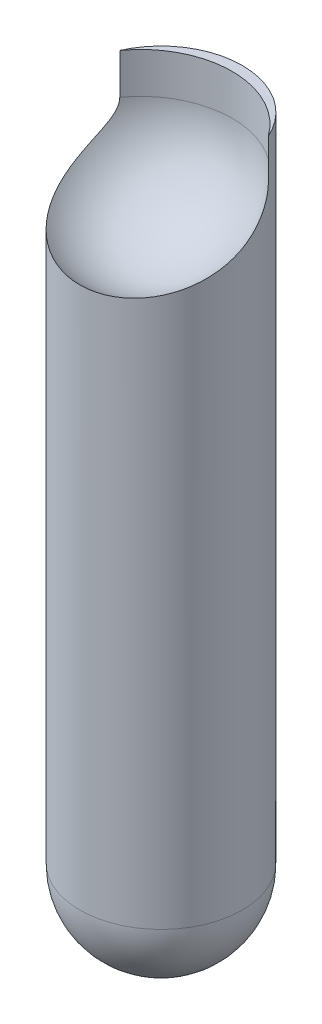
from build123d import *

# Parameters (mm, degrees)
SKETCH2_R           = 50.8
BOSS_EXTRUDE1_DEPTH = 457.2
FILLET1_R           = 50.8


with BuildPart() as part:
    # Sketch2 → Boss-Extrude1 (new body)
    with BuildSketch(Plane(origin=(0, 0, 0), x_dir=(1, 0, 0), z_dir=(0, 1, 0))):
        with Locations(Location((0, 0, 0), (0, 0, 270))):
            Circle(SKETCH2_R)
    extrude(amount=BOSS_EXTRUDE1_DEPTH)

    # Fillet1
    fillet1_edges = [part.edges().sort_by_distance(p)[0] for p in [
        (0, 0, -50.8),
    ]]
    fillet(fillet1_edges, radius=FILLET1_R)

    # Sketch3 → Cut-Revolve1 (revolve, cut)
    with BuildSketch(Plane.ZY):
        with BuildLine():
            Line((-44.45, 431.8), (-44.45, 457.2))
            Line((-44.45, 457.2), (12.7, 457.2))
            Line((12.7, 457.2), (12.7, 374.65))
            ThreePointArc((12.7, 374.65), (-27.711152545, 391.388847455), (-44.45, 431.8))
        make_face()
    revolve(axis=Axis((0, 374.65, 12.7), (0, 1, 0)), mode=Mode.SUBTRACT)


solid = part.part
